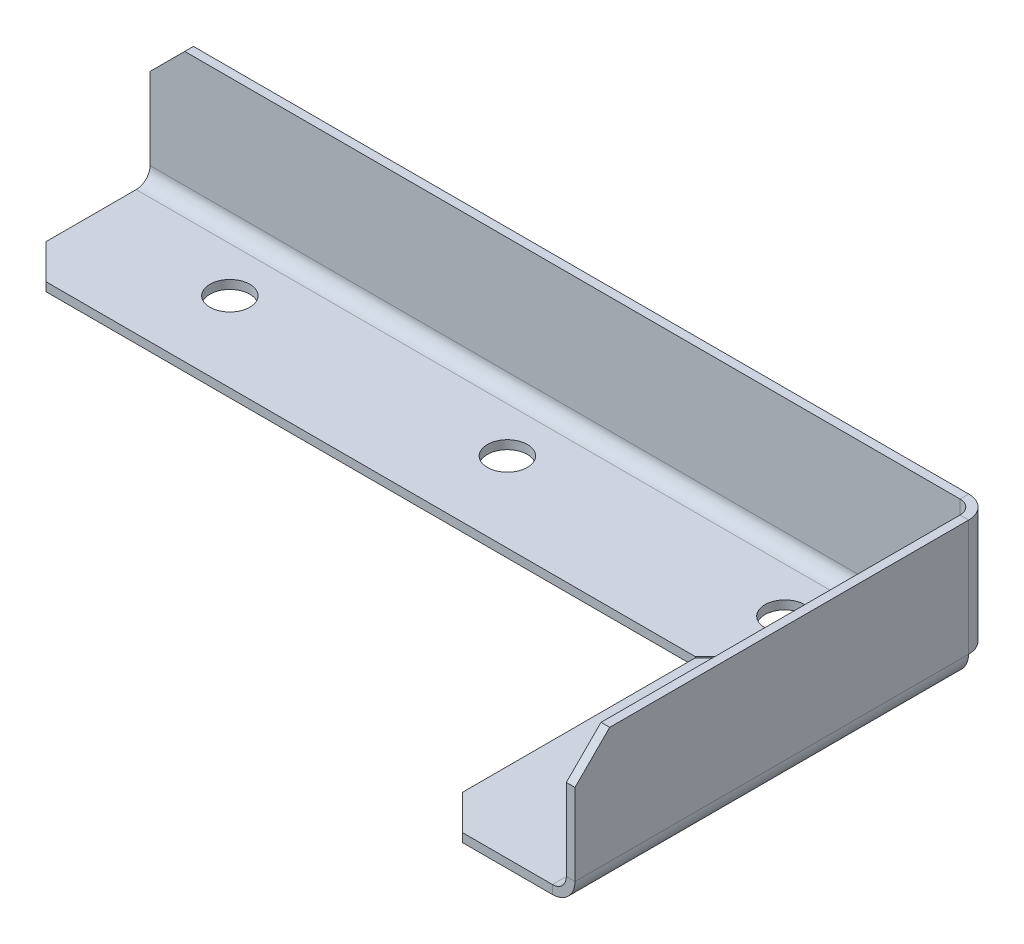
ISO-10303-21;
HEADER;
FILE_DESCRIPTION(('STEP AP214'),'2;1');
FILE_NAME('part.step','',(''),(''),'','','');
FILE_SCHEMA(('AUTOMOTIVE_DESIGN { 1 0 10303 214 1 1 1 1 }'));
ENDSEC;
DATA;
#1=APPLICATION_CONTEXT('core data for automotive mechanical design processes');
#2=APPLICATION_PROTOCOL_DEFINITION('international standard','automotive_design',2000,#1);
#3=PRODUCT_CONTEXT('',#1,'mechanical');
#4=PRODUCT('Part','Part','',(#3));
#5=PRODUCT_RELATED_PRODUCT_CATEGORY('part','',(#4));
#6=PRODUCT_DEFINITION_FORMATION('','',#4);
#7=PRODUCT_DEFINITION_CONTEXT('part definition',#1,'design');
#8=PRODUCT_DEFINITION('design','',#6,#7);
#9=PRODUCT_DEFINITION_SHAPE('','',#8);
#10=(LENGTH_UNIT() NAMED_UNIT(*) SI_UNIT(.MILLI.,.METRE.));
#11=(NAMED_UNIT(*) PLANE_ANGLE_UNIT() SI_UNIT($,.RADIAN.));
#12=(NAMED_UNIT(*) SI_UNIT($,.STERADIAN.) SOLID_ANGLE_UNIT());
#13=UNCERTAINTY_MEASURE_WITH_UNIT(LENGTH_MEASURE(1.E-05),#10,'distance_accuracy_value','');
#14=(GEOMETRIC_REPRESENTATION_CONTEXT(3) GLOBAL_UNCERTAINTY_ASSIGNED_CONTEXT((#13)) GLOBAL_UNIT_ASSIGNED_CONTEXT((#10,
#11,#12)) REPRESENTATION_CONTEXT('',''));
#15=CARTESIAN_POINT('',(0.,0.,0.));
#16=DIRECTION('',(0.,0.,1.));
#17=DIRECTION('',(1.,0.,0.));
#18=AXIS2_PLACEMENT_3D('',#15,#16,#17);
#19=CARTESIAN_POINT('',(-1.5875,4.1275,4.1275));
#20=DIRECTION('',(0.,-1.,0.));
#21=DIRECTION('',(0.,0.,-1.));
#22=AXIS2_PLACEMENT_3D('',#19,#20,#21);
#23=PLANE('',#22);
#24=CARTESIAN_POINT('',(-4.1275,4.1275,4.1275));
#25=DIRECTION('',(0.,1.,0.));
#26=DIRECTION('',(0.,0.,1.));
#27=AXIS2_PLACEMENT_3D('',#24,#25,#26);
#28=CIRCLE('',#27,4.1275);
#29=CARTESIAN_POINT('',(-4.1275000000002,4.1275,0.));
#30=VERTEX_POINT('',#29);
#31=CARTESIAN_POINT('',(0.,4.1275,4.1275));
#32=VERTEX_POINT('',#31);
#33=EDGE_CURVE('E263',#30,#32,#28,.F.);
#34=ORIENTED_EDGE('',*,*,#33,.T.);
#35=DIRECTION('',(1.,0.,0.));
#36=VECTOR('',#35,1.);
#37=CARTESIAN_POINT('',(0.,4.1275,4.12749999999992));
#38=LINE('',#37,#36);
#39=CARTESIAN_POINT('',(-1.5875,4.1275,4.1275));
#40=VERTEX_POINT('',#39);
#41=EDGE_CURVE('E175',#32,#40,#38,.F.);
#42=ORIENTED_EDGE('',*,*,#41,.T.);
#43=CARTESIAN_POINT('',(-4.1275,4.1275,4.1275));
#44=DIRECTION('',(0.,1.,0.));
#45=DIRECTION('',(0.,0.,1.));
#46=AXIS2_PLACEMENT_3D('',#43,#44,#45);
#47=CIRCLE('',#46,2.54);
#48=CARTESIAN_POINT('',(-4.1275,4.1275,1.5875));
#49=VERTEX_POINT('',#48);
#50=EDGE_CURVE('E267',#49,#40,#47,.F.);
#51=ORIENTED_EDGE('',*,*,#50,.F.);
#52=DIRECTION('',(0.,0.,-1.));
#53=VECTOR('',#52,1.);
#54=CARTESIAN_POINT('',(-4.1275000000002,4.1275,0.));
#55=LINE('',#54,#53);
#56=EDGE_CURVE('E230',#30,#49,#55,.F.);
#57=ORIENTED_EDGE('',*,*,#56,.F.);
#58=EDGE_LOOP('',(#34,#42,#51,#57));
#59=FACE_BOUND('',#58,.T.);
#60=ADVANCED_FACE('F30',(#59),#23,.T.);
#61=CARTESIAN_POINT('',(-1.5875,25.4,0.));
#62=DIRECTION('',(1.,0.,0.));
#63=DIRECTION('',(0.,0.,-1.));
#64=AXIS2_PLACEMENT_3D('',#61,#62,#63);
#65=PLANE('',#64);
#66=DIRECTION('',(0.,-1.,0.));
#67=VECTOR('',#66,1.);
#68=CARTESIAN_POINT('',(-1.58749999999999,25.4,76.2));
#69=LINE('',#68,#67);
#70=CARTESIAN_POINT('',(-1.58749999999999,19.05,76.2));
#71=VERTEX_POINT('',#70);
#72=CARTESIAN_POINT('',(-1.58749999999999,4.1275,76.2));
#73=VERTEX_POINT('',#72);
#74=EDGE_CURVE('E301',#71,#73,#69,.T.);
#75=ORIENTED_EDGE('',*,*,#74,.F.);
#76=DIRECTION('',(0.,-0.707106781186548,0.707106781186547));
#77=VECTOR('',#76,1.);
#78=CARTESIAN_POINT('',(-1.58749999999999,19.05,76.2));
#79=LINE('',#78,#77);
#80=CARTESIAN_POINT('',(-1.58749999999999,25.4,69.85));
#81=VERTEX_POINT('',#80);
#82=EDGE_CURVE('E52',#71,#81,#79,.F.);
#83=ORIENTED_EDGE('',*,*,#82,.T.);
#84=DIRECTION('',(0.,0.,1.));
#85=VECTOR('',#84,1.);
#86=CARTESIAN_POINT('',(-1.5875,25.4,0.));
#87=LINE('',#86,#85);
#88=CARTESIAN_POINT('',(-1.5875,25.4,4.1275));
#89=VERTEX_POINT('',#88);
#90=EDGE_CURVE('E270',#89,#81,#87,.T.);
#91=ORIENTED_EDGE('',*,*,#90,.F.);
#92=DIRECTION('',(0.,-1.,0.));
#93=VECTOR('',#92,1.);
#94=CARTESIAN_POINT('',(-1.5875,25.4,4.1275));
#95=LINE('',#94,#93);
#96=EDGE_CURVE('E284',#89,#40,#95,.T.);
#97=ORIENTED_EDGE('',*,*,#96,.T.);
#98=DIRECTION('',(0.,0.,1.));
#99=VECTOR('',#98,1.);
#100=CARTESIAN_POINT('',(-1.58749999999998,4.1275,4.12749999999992));
#101=LINE('',#100,#99);
#102=EDGE_CURVE('E348',#40,#73,#101,.T.);
#103=ORIENTED_EDGE('',*,*,#102,.T.);
#104=EDGE_LOOP('',(#75,#83,#91,#97,#103));
#105=FACE_BOUND('',#104,.T.);
#106=ADVANCED_FACE('F346',(#105),#65,.F.);
#107=CARTESIAN_POINT('',(0.,25.4,76.2));
#108=DIRECTION('',(0.,0.,1.));
#109=DIRECTION('',(1.,0.,0.));
#110=AXIS2_PLACEMENT_3D('',#107,#108,#109);
#111=PLANE('',#110);
#112=DIRECTION('',(0.,-1.,0.));
#113=VECTOR('',#112,1.);
#114=CARTESIAN_POINT('',(0.,25.4,76.2));
#115=LINE('',#114,#113);
#116=CARTESIAN_POINT('',(0.,19.05,76.2));
#117=VERTEX_POINT('',#116);
#118=CARTESIAN_POINT('',(1.27208147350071E-13,4.1275,76.1999999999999));
#119=VERTEX_POINT('',#118);
#120=EDGE_CURVE('E299',#117,#119,#115,.T.);
#121=ORIENTED_EDGE('',*,*,#120,.F.);
#122=DIRECTION('',(-1.,0.,0.));
#123=VECTOR('',#122,1.);
#124=CARTESIAN_POINT('',(0.,19.05,76.2));
#125=LINE('',#124,#123);
#126=EDGE_CURVE('E335',#117,#71,#125,.T.);
#127=ORIENTED_EDGE('',*,*,#126,.T.);
#128=ORIENTED_EDGE('',*,*,#74,.T.);
#129=DIRECTION('',(1.,0.,0.));
#130=VECTOR('',#129,1.);
#131=CARTESIAN_POINT('',(1.27208147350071E-13,4.1275,76.1999999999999));
#132=LINE('',#131,#130);
#133=EDGE_CURVE('E361',#119,#73,#132,.F.);
#134=ORIENTED_EDGE('',*,*,#133,.F.);
#135=EDGE_LOOP('',(#121,#127,#128,#134));
#136=FACE_BOUND('',#135,.T.);
#137=ADVANCED_FACE('F341',(#136),#111,.T.);
#138=CARTESIAN_POINT('',(0.,25.4,0.));
#139=DIRECTION('',(1.,0.,0.));
#140=DIRECTION('',(0.,0.,-1.));
#141=AXIS2_PLACEMENT_3D('',#138,#139,#140);
#142=PLANE('',#141);
#143=DIRECTION('',(0.,0.,1.));
#144=VECTOR('',#143,1.);
#145=CARTESIAN_POINT('',(0.,25.4,0.));
#146=LINE('',#145,#144);
#147=CARTESIAN_POINT('',(0.,25.4,4.1275));
#148=VERTEX_POINT('',#147);
#149=CARTESIAN_POINT('',(0.,25.4,69.85));
#150=VERTEX_POINT('',#149);
#151=EDGE_CURVE('E272',#148,#150,#146,.T.);
#152=ORIENTED_EDGE('',*,*,#151,.T.);
#153=DIRECTION('',(0.,0.707106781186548,-0.707106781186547));
#154=VECTOR('',#153,1.);
#155=CARTESIAN_POINT('',(0.,60.325,34.925));
#156=LINE('',#155,#154);
#157=EDGE_CURVE('E11',#150,#117,#156,.F.);
#158=ORIENTED_EDGE('',*,*,#157,.T.);
#159=ORIENTED_EDGE('',*,*,#120,.T.);
#160=DIRECTION('',(0.,0.,1.));
#161=VECTOR('',#160,1.);
#162=CARTESIAN_POINT('',(0.,4.1275,4.12749999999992));
#163=LINE('',#162,#161);
#164=EDGE_CURVE('E179',#32,#119,#163,.T.);
#165=ORIENTED_EDGE('',*,*,#164,.F.);
#166=DIRECTION('',(0.,-1.,0.));
#167=VECTOR('',#166,1.);
#168=CARTESIAN_POINT('',(0.,25.4,4.1275));
#169=LINE('',#168,#167);
#170=EDGE_CURVE('E296',#148,#32,#169,.T.);
#171=ORIENTED_EDGE('',*,*,#170,.F.);
#172=EDGE_LOOP('',(#152,#158,#159,#165,#171));
#173=FACE_BOUND('',#172,.T.);
#174=ADVANCED_FACE('F437',(#173),#142,.T.);
#175=CARTESIAN_POINT('',(-4.1275,25.4,4.1275));
#176=DIRECTION('',(0.,-1.,0.));
#177=DIRECTION('',(0.,0.,-1.));
#178=AXIS2_PLACEMENT_3D('',#175,#176,#177);
#179=CYLINDRICAL_SURFACE('',#178,4.1275);
#180=ORIENTED_EDGE('',*,*,#170,.T.);
#181=ORIENTED_EDGE('',*,*,#33,.F.);
#182=DIRECTION('',(0.,-1.,0.));
#183=VECTOR('',#182,1.);
#184=CARTESIAN_POINT('',(-4.1275,25.4,0.));
#185=LINE('',#184,#183);
#186=CARTESIAN_POINT('',(-4.1275,25.4,0.));
#187=VERTEX_POINT('',#186);
#188=EDGE_CURVE('E294',#187,#30,#185,.T.);
#189=ORIENTED_EDGE('',*,*,#188,.F.);
#190=CARTESIAN_POINT('',(-4.1275,25.4,4.1275));
#191=DIRECTION('',(0.,1.,0.));
#192=DIRECTION('',(0.,0.,1.));
#193=AXIS2_PLACEMENT_3D('',#190,#191,#192);
#194=CIRCLE('',#193,4.1275);
#195=EDGE_CURVE('E274',#187,#148,#194,.F.);
#196=ORIENTED_EDGE('',*,*,#195,.T.);
#197=EDGE_LOOP('',(#180,#181,#189,#196));
#198=FACE_BOUND('',#197,.T.);
#199=ADVANCED_FACE('F434',(#198),#179,.T.);
#200=CARTESIAN_POINT('',(0.,25.4,0.));
#201=DIRECTION('',(0.,0.,-1.));
#202=DIRECTION('',(-1.,0.,0.));
#203=AXIS2_PLACEMENT_3D('',#200,#201,#202);
#204=PLANE('',#203);
#205=DIRECTION('',(0.,-1.,0.));
#206=VECTOR('',#205,1.);
#207=CARTESIAN_POINT('',(-152.4,25.4,0.));
#208=LINE('',#207,#206);
#209=CARTESIAN_POINT('',(-152.4,19.05,0.));
#210=VERTEX_POINT('',#209);
#211=CARTESIAN_POINT('',(-152.4,4.1275,0.));
#212=VERTEX_POINT('',#211);
#213=EDGE_CURVE('E292',#210,#212,#208,.T.);
#214=ORIENTED_EDGE('',*,*,#213,.F.);
#215=DIRECTION('',(-0.707106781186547,-0.707106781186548,0.));
#216=VECTOR('',#215,1.);
#217=CARTESIAN_POINT('',(-73.0250000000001,98.425,0.));
#218=LINE('',#217,#216);
#219=CARTESIAN_POINT('',(-146.05,25.4,0.));
#220=VERTEX_POINT('',#219);
#221=EDGE_CURVE('E329',#210,#220,#218,.F.);
#222=ORIENTED_EDGE('',*,*,#221,.T.);
#223=DIRECTION('',(1.,0.,0.));
#224=VECTOR('',#223,1.);
#225=CARTESIAN_POINT('',(0.,25.4,0.));
#226=LINE('',#225,#224);
#227=EDGE_CURVE('E277',#220,#187,#226,.T.);
#228=ORIENTED_EDGE('',*,*,#227,.T.);
#229=ORIENTED_EDGE('',*,*,#188,.T.);
#230=DIRECTION('',(1.,0.,0.));
#231=VECTOR('',#230,1.);
#232=CARTESIAN_POINT('',(-893.7625,4.1275,0.));
#233=LINE('',#232,#231);
#234=EDGE_CURVE('E205',#212,#30,#233,.T.);
#235=ORIENTED_EDGE('',*,*,#234,.F.);
#236=EDGE_LOOP('',(#214,#222,#228,#229,#235));
#237=FACE_BOUND('',#236,.T.);
#238=ADVANCED_FACE('F430',(#237),#204,.T.);
#239=CARTESIAN_POINT('',(-152.4,25.4,1.58750000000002));
#240=DIRECTION('',(-1.,0.,0.));
#241=DIRECTION('',(0.,0.,1.));
#242=AXIS2_PLACEMENT_3D('',#239,#240,#241);
#243=PLANE('',#242);
#244=DIRECTION('',(0.,-1.,0.));
#245=VECTOR('',#244,1.);
#246=CARTESIAN_POINT('',(-152.4,25.4,1.58750000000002));
#247=LINE('',#246,#245);
#248=CARTESIAN_POINT('',(-152.4,19.05,1.58750000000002));
#249=VERTEX_POINT('',#248);
#250=CARTESIAN_POINT('',(-152.4,4.1275,1.58750000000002));
#251=VERTEX_POINT('',#250);
#252=EDGE_CURVE('E290',#249,#251,#247,.T.);
#253=ORIENTED_EDGE('',*,*,#252,.F.);
#254=DIRECTION('',(0.,0.,-1.));
#255=VECTOR('',#254,1.);
#256=CARTESIAN_POINT('',(-152.4,19.05,1.58750000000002));
#257=LINE('',#256,#255);
#258=EDGE_CURVE('E326',#249,#210,#257,.T.);
#259=ORIENTED_EDGE('',*,*,#258,.T.);
#260=ORIENTED_EDGE('',*,*,#213,.T.);
#261=DIRECTION('',(0.,0.,-1.));
#262=VECTOR('',#261,1.);
#263=CARTESIAN_POINT('',(-152.4,4.1275,0.));
#264=LINE('',#263,#262);
#265=EDGE_CURVE('E231',#212,#251,#264,.F.);
#266=ORIENTED_EDGE('',*,*,#265,.T.);
#267=EDGE_LOOP('',(#253,#259,#260,#266));
#268=FACE_BOUND('',#267,.T.);
#269=ADVANCED_FACE('F426',(#268),#243,.T.);
#270=CARTESIAN_POINT('',(0.,25.4,1.5875));
#271=DIRECTION('',(0.,0.,-1.));
#272=DIRECTION('',(-1.,0.,0.));
#273=AXIS2_PLACEMENT_3D('',#270,#271,#272);
#274=PLANE('',#273);
#275=DIRECTION('',(1.,0.,0.));
#276=VECTOR('',#275,1.);
#277=CARTESIAN_POINT('',(0.,25.4,1.5875));
#278=LINE('',#277,#276);
#279=CARTESIAN_POINT('',(-146.05,25.4,1.58750000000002));
#280=VERTEX_POINT('',#279);
#281=CARTESIAN_POINT('',(-4.1275,25.4,1.5875));
#282=VERTEX_POINT('',#281);
#283=EDGE_CURVE('E279',#280,#282,#278,.T.);
#284=ORIENTED_EDGE('',*,*,#283,.F.);
#285=DIRECTION('',(0.707106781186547,0.707106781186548,0.));
#286=VECTOR('',#285,1.);
#287=CARTESIAN_POINT('',(-152.4,19.05,1.58750000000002));
#288=LINE('',#287,#286);
#289=EDGE_CURVE('E333',#280,#249,#288,.F.);
#290=ORIENTED_EDGE('',*,*,#289,.T.);
#291=ORIENTED_EDGE('',*,*,#252,.T.);
#292=DIRECTION('',(1.,0.,0.));
#293=VECTOR('',#292,1.);
#294=CARTESIAN_POINT('',(-893.7625,4.1275,1.58750000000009));
#295=LINE('',#294,#293);
#296=EDGE_CURVE('E222',#251,#49,#295,.T.);
#297=ORIENTED_EDGE('',*,*,#296,.T.);
#298=DIRECTION('',(0.,-1.,0.));
#299=VECTOR('',#298,1.);
#300=CARTESIAN_POINT('',(-4.1275,25.4,1.5875));
#301=LINE('',#300,#299);
#302=EDGE_CURVE('E287',#282,#49,#301,.T.);
#303=ORIENTED_EDGE('',*,*,#302,.F.);
#304=EDGE_LOOP('',(#284,#290,#291,#297,#303));
#305=FACE_BOUND('',#304,.T.);
#306=ADVANCED_FACE('F422',(#305),#274,.F.);
#307=CARTESIAN_POINT('',(-4.1275,25.4,4.1275));
#308=DIRECTION('',(0.,-1.,0.));
#309=DIRECTION('',(0.,0.,-1.));
#310=AXIS2_PLACEMENT_3D('',#307,#308,#309);
#311=CYLINDRICAL_SURFACE('',#310,2.54);
#312=ORIENTED_EDGE('',*,*,#50,.T.);
#313=ORIENTED_EDGE('',*,*,#96,.F.);
#314=CARTESIAN_POINT('',(-4.1275,25.4,4.1275));
#315=DIRECTION('',(0.,1.,0.));
#316=DIRECTION('',(1.,0.,0.));
#317=AXIS2_PLACEMENT_3D('',#314,#315,#316);
#318=CIRCLE('',#317,2.54);
#319=EDGE_CURVE('E281',#282,#89,#318,.F.);
#320=ORIENTED_EDGE('',*,*,#319,.F.);
#321=ORIENTED_EDGE('',*,*,#302,.T.);
#322=EDGE_LOOP('',(#312,#313,#320,#321));
#323=FACE_BOUND('',#322,.T.);
#324=ADVANCED_FACE('F419',(#323),#311,.F.);
#325=CARTESIAN_POINT('',(0.,25.4,4.1275));
#326=DIRECTION('',(0.,1.,0.));
#327=DIRECTION('',(0.,0.,1.));
#328=AXIS2_PLACEMENT_3D('',#325,#326,#327);
#329=PLANE('',#328);
#330=DIRECTION('',(-1.,0.,0.));
#331=VECTOR('',#330,1.);
#332=CARTESIAN_POINT('',(0.,25.4,4.1275));
#333=LINE('',#332,#331);
#334=EDGE_CURVE('E306',#148,#89,#333,.T.);
#335=ORIENTED_EDGE('',*,*,#334,.F.);
#336=ORIENTED_EDGE('',*,*,#195,.F.);
#337=DIRECTION('',(0.,0.,-1.));
#338=VECTOR('',#337,1.);
#339=CARTESIAN_POINT('',(-4.1275,25.4,1.5875));
#340=LINE('',#339,#338);
#341=EDGE_CURVE('E303',#282,#187,#340,.T.);
#342=ORIENTED_EDGE('',*,*,#341,.F.);
#343=ORIENTED_EDGE('',*,*,#319,.T.);
#344=EDGE_LOOP('',(#335,#336,#342,#343));
#345=FACE_BOUND('',#344,.T.);
#346=ADVANCED_FACE('F32',(#345),#329,.T.);
#347=CARTESIAN_POINT('',(-4.1275,25.4,1.5875));
#348=DIRECTION('',(0.,1.,0.));
#349=DIRECTION('',(0.,0.,1.));
#350=AXIS2_PLACEMENT_3D('',#347,#348,#349);
#351=PLANE('',#350);
#352=ORIENTED_EDGE('',*,*,#90,.T.);
#353=DIRECTION('',(1.,0.,0.));
#354=VECTOR('',#353,1.);
#355=CARTESIAN_POINT('',(-4.1275,25.4,69.85));
#356=LINE('',#355,#354);
#357=EDGE_CURVE('E38',#81,#150,#356,.T.);
#358=ORIENTED_EDGE('',*,*,#357,.T.);
#359=ORIENTED_EDGE('',*,*,#151,.F.);
#360=ORIENTED_EDGE('',*,*,#334,.T.);
#361=EDGE_LOOP('',(#352,#358,#359,#360));
#362=FACE_BOUND('',#361,.T.);
#363=ADVANCED_FACE('F417',(#362),#351,.T.);
#364=CARTESIAN_POINT('',(-4.1275,25.4,4.1275));
#365=DIRECTION('',(0.,1.,0.));
#366=DIRECTION('',(0.,0.,1.));
#367=AXIS2_PLACEMENT_3D('',#364,#365,#366);
#368=PLANE('',#367);
#369=ORIENTED_EDGE('',*,*,#227,.F.);
#370=DIRECTION('',(0.,0.,1.));
#371=VECTOR('',#370,1.);
#372=CARTESIAN_POINT('',(-146.05,25.4,4.1275));
#373=LINE('',#372,#371);
#374=EDGE_CURVE('E331',#220,#280,#373,.T.);
#375=ORIENTED_EDGE('',*,*,#374,.T.);
#376=ORIENTED_EDGE('',*,*,#283,.T.);
#377=ORIENTED_EDGE('',*,*,#341,.T.);
#378=EDGE_LOOP('',(#369,#375,#376,#377));
#379=FACE_BOUND('',#378,.T.);
#380=ADVANCED_FACE('F413',(#379),#368,.T.);
#381=CARTESIAN_POINT('',(-152.4,0.,26.9875));
#382=DIRECTION('',(0.,0.,-1.));
#383=DIRECTION('',(1.,0.,0.));
#384=AXIS2_PLACEMENT_3D('',#381,#382,#383);
#385=PLANE('',#384);
#386=DIRECTION('',(1.,0.,0.));
#387=VECTOR('',#386,1.);
#388=CARTESIAN_POINT('',(-152.4,1.5875,26.9875));
#389=LINE('',#388,#387);
#390=CARTESIAN_POINT('',(-146.05,1.5875,26.9875));
#391=VERTEX_POINT('',#390);
#392=CARTESIAN_POINT('',(-27.16710512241,1.5875,26.9875));
#393=VERTEX_POINT('',#392);
#394=EDGE_CURVE('E246',#391,#393,#389,.T.);
#395=ORIENTED_EDGE('',*,*,#394,.F.);
#396=DIRECTION('',(0.,-1.,0.));
#397=VECTOR('',#396,1.);
#398=CARTESIAN_POINT('',(-146.05,0.,26.9875));
#399=LINE('',#398,#397);
#400=CARTESIAN_POINT('',(-146.05,0.,26.9875));
#401=VERTEX_POINT('',#400);
#402=EDGE_CURVE('E313',#391,#401,#399,.T.);
#403=ORIENTED_EDGE('',*,*,#402,.T.);
#404=DIRECTION('',(1.,0.,0.));
#405=VECTOR('',#404,1.);
#406=CARTESIAN_POINT('',(-152.4,0.,26.9875));
#407=LINE('',#406,#405);
#408=CARTESIAN_POINT('',(-27.16710512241,0.,26.9875));
#409=VERTEX_POINT('',#408);
#410=EDGE_CURVE('E234',#401,#409,#407,.T.);
#411=ORIENTED_EDGE('',*,*,#410,.T.);
#412=DIRECTION('',(0.,-1.,0.));
#413=VECTOR('',#412,1.);
#414=CARTESIAN_POINT('',(-27.16710512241,0.,26.9875));
#415=LINE('',#414,#413);
#416=EDGE_CURVE('E260',#409,#393,#415,.F.);
#417=ORIENTED_EDGE('',*,*,#416,.T.);
#418=EDGE_LOOP('',(#395,#403,#411,#417));
#419=FACE_BOUND('',#418,.T.);
#420=ADVANCED_FACE('F416',(#419),#385,.F.);
#421=CARTESIAN_POINT('',(-152.4,0.,26.9875));
#422=DIRECTION('',(-1.,0.,0.));
#423=DIRECTION('',(0.,0.,-1.));
#424=AXIS2_PLACEMENT_3D('',#421,#422,#423);
#425=PLANE('',#424);
#426=DIRECTION('',(0.,0.,-1.));
#427=VECTOR('',#426,1.);
#428=CARTESIAN_POINT('',(-152.4,0.,26.9875));
#429=LINE('',#428,#427);
#430=CARTESIAN_POINT('',(-152.4,0.,20.6375));
#431=VERTEX_POINT('',#430);
#432=CARTESIAN_POINT('',(-152.4,0.,4.1275));
#433=VERTEX_POINT('',#432);
#434=EDGE_CURVE('E241',#431,#433,#429,.T.);
#435=ORIENTED_EDGE('',*,*,#434,.F.);
#436=DIRECTION('',(0.,-1.,0.));
#437=VECTOR('',#436,1.);
#438=CARTESIAN_POINT('',(-152.4,0.,20.6375));
#439=LINE('',#438,#437);
#440=CARTESIAN_POINT('',(-152.4,1.5875,20.6375));
#441=VERTEX_POINT('',#440);
#442=EDGE_CURVE('E308',#431,#441,#439,.F.);
#443=ORIENTED_EDGE('',*,*,#442,.T.);
#444=DIRECTION('',(0.,0.,-1.));
#445=VECTOR('',#444,1.);
#446=CARTESIAN_POINT('',(-152.4,1.5875,26.9875));
#447=LINE('',#446,#445);
#448=CARTESIAN_POINT('',(-152.4,1.5875,4.1275));
#449=VERTEX_POINT('',#448);
#450=EDGE_CURVE('E251',#441,#449,#447,.T.);
#451=ORIENTED_EDGE('',*,*,#450,.T.);
#452=DIRECTION('',(0.,-1.,0.));
#453=VECTOR('',#452,1.);
#454=CARTESIAN_POINT('',(-152.4,0.,4.1275));
#455=LINE('',#454,#453);
#456=EDGE_CURVE('E257',#433,#449,#455,.F.);
#457=ORIENTED_EDGE('',*,*,#456,.F.);
#458=EDGE_LOOP('',(#435,#443,#451,#457));
#459=FACE_BOUND('',#458,.T.);
#460=ADVANCED_FACE('F646',(#459),#425,.T.);
#461=CARTESIAN_POINT('',(-89.7835525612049,0.,89.6039474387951));
#462=DIRECTION('',(0.707106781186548,0.,0.707106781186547));
#463=DIRECTION('',(-0.707106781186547,0.,0.707106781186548));
#464=AXIS2_PLACEMENT_3D('',#461,#462,#463);
#465=PLANE('',#464);
#466=DIRECTION('',(-0.707106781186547,0.,0.707106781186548));
#467=VECTOR('',#466,1.);
#468=CARTESIAN_POINT('',(-89.7835525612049,0.,89.6039474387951));
#469=LINE('',#468,#467);
#470=CARTESIAN_POINT('',(-4.30710512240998,0.,4.12749999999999));
#471=VERTEX_POINT('',#470);
#472=EDGE_CURVE('E240',#471,#409,#469,.T.);
#473=ORIENTED_EDGE('',*,*,#472,.F.);
#474=DIRECTION('',(0.,-1.,0.));
#475=VECTOR('',#474,1.);
#476=CARTESIAN_POINT('',(-4.30710512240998,0.,4.12749999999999));
#477=LINE('',#476,#475);
#478=CARTESIAN_POINT('',(-4.30710512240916,1.5875,4.12749999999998));
#479=VERTEX_POINT('',#478);
#480=EDGE_CURVE('E256',#471,#479,#477,.F.);
#481=ORIENTED_EDGE('',*,*,#480,.T.);
#482=DIRECTION('',(-0.707106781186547,0.,0.707106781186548));
#483=VECTOR('',#482,1.);
#484=CARTESIAN_POINT('',(-89.7835525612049,1.58749999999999,89.6039474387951));
#485=LINE('',#484,#483);
#486=EDGE_CURVE('E250',#479,#393,#485,.T.);
#487=ORIENTED_EDGE('',*,*,#486,.T.);
#488=ORIENTED_EDGE('',*,*,#416,.F.);
#489=EDGE_LOOP('',(#473,#481,#487,#488));
#490=FACE_BOUND('',#489,.T.);
#491=ADVANCED_FACE('F411',(#490),#465,.T.);
#492=CARTESIAN_POINT('',(-152.4,1.5875,26.9875));
#493=DIRECTION('',(0.,-1.,0.));
#494=DIRECTION('',(0.,0.,-1.));
#495=AXIS2_PLACEMENT_3D('',#492,#493,#494);
#496=PLANE('',#495);
#497=CARTESIAN_POINT('',(-76.2000000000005,1.58750000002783,12.3825));
#498=DIRECTION('',(0.,1.,0.));
#499=DIRECTION('',(0.,0.,1.));
#500=AXIS2_PLACEMENT_3D('',#497,#498,#499);
#501=CIRCLE('',#500,3.65125000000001);
#502=CARTESIAN_POINT('',(-76.2000000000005,1.58750000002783,16.03375));
#503=VERTEX_POINT('',#502);
#504=EDGE_CURVE('E515',#503,#503,#501,.T.);
#505=ORIENTED_EDGE('',*,*,#504,.F.);
#506=EDGE_LOOP('',(#505));
#507=FACE_BOUND('',#506,.T.);
#508=CARTESIAN_POINT('',(-25.4000000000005,1.58750000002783,12.3825));
#509=DIRECTION('',(0.,1.,0.));
#510=DIRECTION('',(0.,0.,1.));
#511=AXIS2_PLACEMENT_3D('',#508,#509,#510);
#512=CIRCLE('',#511,3.65125000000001);
#513=CARTESIAN_POINT('',(-25.4000000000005,1.58750000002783,16.03375));
#514=VERTEX_POINT('',#513);
#515=EDGE_CURVE('E498',#514,#514,#512,.T.);
#516=ORIENTED_EDGE('',*,*,#515,.F.);
#517=EDGE_LOOP('',(#516));
#518=FACE_BOUND('',#517,.T.);
#519=CARTESIAN_POINT('',(-127.000000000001,1.58750000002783,12.3825));
#520=DIRECTION('',(0.,1.,0.));
#521=DIRECTION('',(0.,0.,1.));
#522=AXIS2_PLACEMENT_3D('',#519,#520,#521);
#523=CIRCLE('',#522,3.65124999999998);
#524=CARTESIAN_POINT('',(-127.000000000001,1.58750000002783,16.03375));
#525=VERTEX_POINT('',#524);
#526=EDGE_CURVE('E489',#525,#525,#523,.T.);
#527=ORIENTED_EDGE('',*,*,#526,.F.);
#528=EDGE_LOOP('',(#527));
#529=FACE_BOUND('',#528,.T.);
#530=ORIENTED_EDGE('',*,*,#450,.F.);
#531=DIRECTION('',(0.707106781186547,0.,0.707106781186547));
#532=VECTOR('',#531,1.);
#533=CARTESIAN_POINT('',(-152.4,1.5875,20.6375));
#534=LINE('',#533,#532);
#535=EDGE_CURVE('E311',#441,#391,#534,.T.);
#536=ORIENTED_EDGE('',*,*,#535,.T.);
#537=ORIENTED_EDGE('',*,*,#394,.T.);
#538=ORIENTED_EDGE('',*,*,#486,.F.);
#539=DIRECTION('',(1.,0.,0.));
#540=VECTOR('',#539,1.);
#541=CARTESIAN_POINT('',(-152.4,1.5875,4.1275));
#542=LINE('',#541,#540);
#543=EDGE_CURVE('E247',#449,#479,#542,.T.);
#544=ORIENTED_EDGE('',*,*,#543,.F.);
#545=EDGE_LOOP('',(#530,#536,#537,#538,#544));
#546=FACE_BOUND('',#545,.T.);
#547=ADVANCED_FACE('F477',(#507,#518,#529,#546),#496,.F.);
#548=CARTESIAN_POINT('',(-152.4,0.,26.9875));
#549=DIRECTION('',(0.,-1.,0.));
#550=DIRECTION('',(0.,0.,-1.));
#551=AXIS2_PLACEMENT_3D('',#548,#549,#550);
#552=PLANE('',#551);
#553=CARTESIAN_POINT('',(-76.2000000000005,0.,12.3825));
#554=DIRECTION('',(0.,-1.,0.));
#555=DIRECTION('',(0.,0.,-1.));
#556=AXIS2_PLACEMENT_3D('',#553,#554,#555);
#557=CIRCLE('',#556,3.65125000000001);
#558=CARTESIAN_POINT('',(-76.2000000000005,0.,8.73125000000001));
#559=VERTEX_POINT('',#558);
#560=EDGE_CURVE('E518',#559,#559,#557,.F.);
#561=ORIENTED_EDGE('',*,*,#560,.T.);
#562=EDGE_LOOP('',(#561));
#563=FACE_BOUND('',#562,.T.);
#564=CARTESIAN_POINT('',(-25.4000000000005,0.,12.3825));
#565=DIRECTION('',(0.,-1.,0.));
#566=DIRECTION('',(0.,0.,-1.));
#567=AXIS2_PLACEMENT_3D('',#564,#565,#566);
#568=CIRCLE('',#567,3.65125000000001);
#569=CARTESIAN_POINT('',(-25.4000000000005,0.,8.73125000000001));
#570=VERTEX_POINT('',#569);
#571=EDGE_CURVE('E500',#570,#570,#568,.F.);
#572=ORIENTED_EDGE('',*,*,#571,.T.);
#573=EDGE_LOOP('',(#572));
#574=FACE_BOUND('',#573,.T.);
#575=CARTESIAN_POINT('',(-127.000000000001,0.,12.3825));
#576=DIRECTION('',(0.,-1.,0.));
#577=DIRECTION('',(0.,0.,-1.));
#578=AXIS2_PLACEMENT_3D('',#575,#576,#577);
#579=CIRCLE('',#578,3.65124999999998);
#580=CARTESIAN_POINT('',(-127.000000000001,0.,8.73125000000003));
#581=VERTEX_POINT('',#580);
#582=EDGE_CURVE('E492',#581,#581,#579,.F.);
#583=ORIENTED_EDGE('',*,*,#582,.T.);
#584=EDGE_LOOP('',(#583));
#585=FACE_BOUND('',#584,.T.);
#586=ORIENTED_EDGE('',*,*,#410,.F.);
#587=DIRECTION('',(-0.707106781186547,0.,-0.707106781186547));
#588=VECTOR('',#587,1.);
#589=CARTESIAN_POINT('',(-149.225,0.,23.8125));
#590=LINE('',#589,#588);
#591=EDGE_CURVE('E315',#401,#431,#590,.T.);
#592=ORIENTED_EDGE('',*,*,#591,.T.);
#593=ORIENTED_EDGE('',*,*,#434,.T.);
#594=DIRECTION('',(1.,0.,0.));
#595=VECTOR('',#594,1.);
#596=CARTESIAN_POINT('',(-152.4,0.,4.1275));
#597=LINE('',#596,#595);
#598=EDGE_CURVE('E237',#433,#471,#597,.T.);
#599=ORIENTED_EDGE('',*,*,#598,.T.);
#600=ORIENTED_EDGE('',*,*,#472,.T.);
#601=EDGE_LOOP('',(#586,#592,#593,#599,#600));
#602=FACE_BOUND('',#601,.T.);
#603=ADVANCED_FACE('F528',(#563,#574,#585,#602),#552,.T.);
#604=CARTESIAN_POINT('',(-152.4,4.1275,4.1275));
#605=DIRECTION('',(1.,0.,0.));
#606=DIRECTION('',(0.,0.,-1.));
#607=AXIS2_PLACEMENT_3D('',#604,#605,#606);
#608=PLANE('',#607);
#609=ORIENTED_EDGE('',*,*,#456,.T.);
#610=CARTESIAN_POINT('',(-152.4,4.1275,4.1275));
#611=DIRECTION('',(1.,0.,0.));
#612=DIRECTION('',(0.,0.,-1.));
#613=AXIS2_PLACEMENT_3D('',#610,#611,#612);
#614=CIRCLE('',#613,2.54);
#615=EDGE_CURVE('E225',#449,#251,#614,.T.);
#616=ORIENTED_EDGE('',*,*,#615,.T.);
#617=ORIENTED_EDGE('',*,*,#265,.F.);
#618=CARTESIAN_POINT('',(-152.4,4.1275,4.1275));
#619=DIRECTION('',(-1.,0.,0.));
#620=DIRECTION('',(0.,0.,1.));
#621=AXIS2_PLACEMENT_3D('',#618,#619,#620);
#622=CIRCLE('',#621,4.1275);
#623=EDGE_CURVE('E209',#433,#212,#622,.F.);
#624=ORIENTED_EDGE('',*,*,#623,.F.);
#625=EDGE_LOOP('',(#609,#616,#617,#624));
#626=FACE_BOUND('',#625,.T.);
#627=ADVANCED_FACE('F467',(#626),#608,.F.);
#628=CARTESIAN_POINT('',(-3.94789487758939,8.255,4.12749999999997));
#629=CARTESIAN_POINT('',(-3.94789487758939,7.72583333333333,4.12749999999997));
#630=CARTESIAN_POINT('',(-3.94789487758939,7.19666666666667,4.12749999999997));
#631=CARTESIAN_POINT('',(-3.94789487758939,6.6675,4.12749999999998));
#632=CARTESIAN_POINT('',(-3.94789487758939,8.25499999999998,-4.12750000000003));
#633=CARTESIAN_POINT('',(-3.94789487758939,7.72583333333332,-3.06916666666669));
#634=CARTESIAN_POINT('',(-3.94789487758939,7.19666666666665,-2.01083333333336));
#635=CARTESIAN_POINT('',(-3.94789487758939,6.66749999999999,-0.952500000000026));
#636=CARTESIAN_POINT('',(-4.30710512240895,0.,-4.12750000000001));
#637=CARTESIAN_POINT('',(-4.30710512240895,0.529166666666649,-3.06916666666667));
#638=CARTESIAN_POINT('',(-4.30710512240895,1.05833333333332,-2.01083333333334));
#639=CARTESIAN_POINT('',(-4.30710512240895,1.58749999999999,-0.952500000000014));
#640=CARTESIAN_POINT('',(-4.30710512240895,0.,4.12749999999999));
#641=CARTESIAN_POINT('',(-4.30710512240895,0.529166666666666,4.12749999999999));
#642=CARTESIAN_POINT('',(-4.30710512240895,1.05833333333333,4.12749999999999));
#643=CARTESIAN_POINT('',(-4.30710512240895,1.5875,4.12749999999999));
#644=CARTESIAN_POINT('',(-4.30710512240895,0.,12.3825));
#645=CARTESIAN_POINT('',(-4.30710512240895,0.529166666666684,11.3241666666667));
#646=CARTESIAN_POINT('',(-4.30710512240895,1.05833333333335,10.2658333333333));
#647=CARTESIAN_POINT('',(-4.30710512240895,1.58750000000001,9.20749999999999));
#648=CARTESIAN_POINT('',(-3.94789487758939,8.25500000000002,12.3825));
#649=CARTESIAN_POINT('',(-3.94789487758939,7.72583333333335,11.3241666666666));
#650=CARTESIAN_POINT('',(-3.94789487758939,7.19666666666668,10.2658333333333));
#651=CARTESIAN_POINT('',(-3.94789487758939,6.66750000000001,9.20749999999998));
#652=CARTESIAN_POINT('',(-3.94789487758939,8.255,4.12749999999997));
#653=CARTESIAN_POINT('',(-3.94789487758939,7.72583333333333,4.12749999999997));
#654=CARTESIAN_POINT('',(-3.94789487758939,7.19666666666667,4.12749999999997));
#655=CARTESIAN_POINT('',(-3.94789487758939,6.6675,4.12749999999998));
#656=(BOUNDED_SURFACE() B_SPLINE_SURFACE(3,3,((#628,#629,#630,#631),(#632,#633,#634,#635),(#636,
#637,#638,#639),(#640,#641,#642,#643),(#644,#645,#646,#647),(#648,#649,#650,#651),(#652,#653,
#654,#655)),.UNSPECIFIED.,.T.,.F.,.F.) B_SPLINE_SURFACE_WITH_KNOTS((4,3,4),(4,4),(0.,0.5,1.),
(0.,1.),.UNSPECIFIED.) GEOMETRIC_REPRESENTATION_ITEM() RATIONAL_B_SPLINE_SURFACE(((1.,1.,1.,1.),
(0.333333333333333,0.333333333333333,0.333333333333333,0.333333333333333),(0.333333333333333,
0.333333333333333,0.333333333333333,0.333333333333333),(1.,1.,1.,1.),(0.333333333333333,
0.333333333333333,0.333333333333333,0.333333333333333),(0.333333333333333,0.333333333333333,
0.333333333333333,0.333333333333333),(1.,1.,1.,1.))) REPRESENTATION_ITEM('') SURFACE());
#657=CARTESIAN_POINT('',(-4.12749999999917,4.1275,4.12749999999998));
#658=DIRECTION('',(0.999054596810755,-0.0434731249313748,0.));
#659=DIRECTION('',(0.0434731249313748,0.999054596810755,0.));
#660=AXIS2_PLACEMENT_3D('',#657,#658,#659);
#661=ELLIPSE('',#660,4.13140584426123,4.1275);
#662=EDGE_CURVE('E219',#30,#471,#661,.F.);
#663=CARTESIAN_POINT('',(-4.12749999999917,4.1275,4.12749999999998));
#664=DIRECTION('',(0.997509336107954,-0.0705345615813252,0.));
#665=DIRECTION('',(0.0705345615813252,0.997509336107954,0.));
#666=AXIS2_PLACEMENT_3D('',#663,#664,#665);
#667=ELLIPSE('',#666,2.54634208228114,2.54);
#668=EDGE_CURVE('E228',#49,#479,#667,.F.);
#669=ORIENTED_EDGE('',*,*,#662,.F.);
#670=ORIENTED_EDGE('',*,*,#56,.T.);
#671=ORIENTED_EDGE('',*,*,#668,.T.);
#672=ORIENTED_EDGE('',*,*,#480,.F.);
#673=EDGE_LOOP('',(#669,#670,#671,#672));
#674=FACE_BOUND('',#673,.T.);
#675=ADVANCED_FACE('F483',(#674),#656,.F.);
#676=CARTESIAN_POINT('',(-893.7625,4.1275,4.12750000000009));
#677=DIRECTION('',(1.,0.,0.));
#678=DIRECTION('',(0.,0.,-1.));
#679=AXIS2_PLACEMENT_3D('',#676,#677,#678);
#680=CYLINDRICAL_SURFACE('',#679,2.54);
#681=ORIENTED_EDGE('',*,*,#296,.F.);
#682=ORIENTED_EDGE('',*,*,#615,.F.);
#683=ORIENTED_EDGE('',*,*,#543,.T.);
#684=ORIENTED_EDGE('',*,*,#668,.F.);
#685=EDGE_LOOP('',(#681,#682,#683,#684));
#686=FACE_BOUND('',#685,.T.);
#687=ADVANCED_FACE('F464',(#686),#680,.F.);
#688=CARTESIAN_POINT('',(-893.7625,4.1275,4.12750000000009));
#689=DIRECTION('',(1.,0.,0.));
#690=DIRECTION('',(0.,0.,-1.));
#691=AXIS2_PLACEMENT_3D('',#688,#689,#690);
#692=CYLINDRICAL_SURFACE('',#691,4.1275);
#693=ORIENTED_EDGE('',*,*,#234,.T.);
#694=ORIENTED_EDGE('',*,*,#662,.T.);
#695=ORIENTED_EDGE('',*,*,#598,.F.);
#696=ORIENTED_EDGE('',*,*,#623,.T.);
#697=EDGE_LOOP('',(#693,#694,#695,#696));
#698=FACE_BOUND('',#697,.T.);
#699=ADVANCED_FACE('F485',(#698),#692,.T.);
#700=CARTESIAN_POINT('',(-26.9874999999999,0.,76.2));
#701=DIRECTION('',(0.,0.,-1.));
#702=DIRECTION('',(1.,0.,0.));
#703=AXIS2_PLACEMENT_3D('',#700,#701,#702);
#704=PLANE('',#703);
#705=DIRECTION('',(1.,0.,0.));
#706=VECTOR('',#705,1.);
#707=CARTESIAN_POINT('',(-26.9874999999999,1.5875,76.1999999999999));
#708=LINE('',#707,#706);
#709=CARTESIAN_POINT('',(-4.12749999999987,1.5875,76.1999999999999));
#710=VERTEX_POINT('',#709);
#711=CARTESIAN_POINT('',(-20.6374999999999,1.5875,76.1999999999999));
#712=VERTEX_POINT('',#711);
#713=EDGE_CURVE('E371',#710,#712,#708,.F.);
#714=ORIENTED_EDGE('',*,*,#713,.T.);
#715=DIRECTION('',(0.,-1.,0.));
#716=VECTOR('',#715,1.);
#717=CARTESIAN_POINT('',(-20.6374999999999,0.,76.1999999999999));
#718=LINE('',#717,#716);
#719=CARTESIAN_POINT('',(-20.6374999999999,0.,76.1999999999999));
#720=VERTEX_POINT('',#719);
#721=EDGE_CURVE('E322',#712,#720,#718,.T.);
#722=ORIENTED_EDGE('',*,*,#721,.T.);
#723=DIRECTION('',(1.,0.,0.));
#724=VECTOR('',#723,1.);
#725=CARTESIAN_POINT('',(-26.9874999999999,0.,76.2));
#726=LINE('',#725,#724);
#727=CARTESIAN_POINT('',(-4.12749999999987,0.,76.1999999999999));
#728=VERTEX_POINT('',#727);
#729=EDGE_CURVE('E190',#728,#720,#726,.F.);
#730=ORIENTED_EDGE('',*,*,#729,.F.);
#731=DIRECTION('',(0.,-1.,0.));
#732=VECTOR('',#731,1.);
#733=CARTESIAN_POINT('',(-4.12749999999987,0.,76.1999999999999));
#734=LINE('',#733,#732);
#735=EDGE_CURVE('E206',#728,#710,#734,.F.);
#736=ORIENTED_EDGE('',*,*,#735,.T.);
#737=EDGE_LOOP('',(#714,#722,#730,#736));
#738=FACE_BOUND('',#737,.T.);
#739=ADVANCED_FACE('F376',(#738),#704,.F.);
#740=CARTESIAN_POINT('',(-26.9875,0.,4.12750000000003));
#741=DIRECTION('',(1.,0.,0.));
#742=DIRECTION('',(0.,0.,1.));
#743=AXIS2_PLACEMENT_3D('',#740,#741,#742);
#744=PLANE('',#743);
#745=DIRECTION('',(0.,0.,1.));
#746=VECTOR('',#745,1.);
#747=CARTESIAN_POINT('',(-26.9875,0.,4.12750000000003));
#748=LINE('',#747,#746);
#749=CARTESIAN_POINT('',(-26.9875,0.,27.167105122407));
#750=VERTEX_POINT('',#749);
#751=CARTESIAN_POINT('',(-26.9874999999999,0.,69.85));
#752=VERTEX_POINT('',#751);
#753=EDGE_CURVE('E191',#750,#752,#748,.T.);
#754=ORIENTED_EDGE('',*,*,#753,.T.);
#755=DIRECTION('',(0.,1.,0.));
#756=VECTOR('',#755,1.);
#757=CARTESIAN_POINT('',(-26.9874999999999,0.,69.85));
#758=LINE('',#757,#756);
#759=CARTESIAN_POINT('',(-26.9874999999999,1.5875,69.85));
#760=VERTEX_POINT('',#759);
#761=EDGE_CURVE('E317',#752,#760,#758,.T.);
#762=ORIENTED_EDGE('',*,*,#761,.T.);
#763=DIRECTION('',(0.,0.,1.));
#764=VECTOR('',#763,1.);
#765=CARTESIAN_POINT('',(-26.9875,1.5875,4.12750000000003));
#766=LINE('',#765,#764);
#767=CARTESIAN_POINT('',(-26.9875,1.5875,27.167105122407));
#768=VERTEX_POINT('',#767);
#769=EDGE_CURVE('E200',#768,#760,#766,.T.);
#770=ORIENTED_EDGE('',*,*,#769,.F.);
#771=DIRECTION('',(0.,-1.,0.));
#772=VECTOR('',#771,1.);
#773=CARTESIAN_POINT('',(-26.9875,0.,27.167105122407));
#774=LINE('',#773,#772);
#775=EDGE_CURVE('E212',#750,#768,#774,.F.);
#776=ORIENTED_EDGE('',*,*,#775,.F.);
#777=EDGE_LOOP('',(#754,#762,#770,#776));
#778=FACE_BOUND('',#777,.T.);
#779=ADVANCED_FACE('F383',(#778),#744,.F.);
#780=CARTESIAN_POINT('',(-15.4676974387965,0.,15.6473025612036));
#781=DIRECTION('',(-0.707106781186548,0.,-0.707106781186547));
#782=DIRECTION('',(0.707106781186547,0.,-0.707106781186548));
#783=AXIS2_PLACEMENT_3D('',#780,#781,#782);
#784=PLANE('',#783);
#785=DIRECTION('',(0.707106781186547,0.,-0.707106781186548));
#786=VECTOR('',#785,1.);
#787=CARTESIAN_POINT('',(-15.4676974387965,0.,15.6473025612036));
#788=LINE('',#787,#786);
#789=CARTESIAN_POINT('',(-4.12749999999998,0.,4.30710512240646));
#790=VERTEX_POINT('',#789);
#791=EDGE_CURVE('E194',#750,#790,#788,.T.);
#792=ORIENTED_EDGE('',*,*,#791,.F.);
#793=ORIENTED_EDGE('',*,*,#775,.T.);
#794=DIRECTION('',(0.707106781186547,0.,-0.707106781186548));
#795=VECTOR('',#794,1.);
#796=CARTESIAN_POINT('',(-15.4676974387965,1.5875,15.6473025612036));
#797=LINE('',#796,#795);
#798=CARTESIAN_POINT('',(-4.12749999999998,1.5875,4.30710512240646));
#799=VERTEX_POINT('',#798);
#800=EDGE_CURVE('E203',#768,#799,#797,.T.);
#801=ORIENTED_EDGE('',*,*,#800,.T.);
#802=DIRECTION('',(0.,-1.,0.));
#803=VECTOR('',#802,1.);
#804=CARTESIAN_POINT('',(-4.12749999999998,0.,4.30710512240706));
#805=LINE('',#804,#803);
#806=EDGE_CURVE('E173',#790,#799,#805,.F.);
#807=ORIENTED_EDGE('',*,*,#806,.F.);
#808=EDGE_LOOP('',(#792,#793,#801,#807));
#809=FACE_BOUND('',#808,.T.);
#810=ADVANCED_FACE('F202',(#809),#784,.T.);
#811=CARTESIAN_POINT('',(-26.9875,1.5875,4.12750000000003));
#812=DIRECTION('',(0.,-1.,0.));
#813=DIRECTION('',(1.,0.,0.));
#814=AXIS2_PLACEMENT_3D('',#811,#812,#813);
#815=PLANE('',#814);
#816=CARTESIAN_POINT('',(-12.3824999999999,1.58750000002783,25.3999999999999));
#817=DIRECTION('',(0.,1.,0.));
#818=DIRECTION('',(0.,0.,1.));
#819=AXIS2_PLACEMENT_3D('',#816,#817,#818);
#820=CIRCLE('',#819,3.65125000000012);
#821=CARTESIAN_POINT('',(-12.3824999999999,1.58750000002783,29.05125));
#822=VERTEX_POINT('',#821);
#823=EDGE_CURVE('E509',#822,#822,#820,.T.);
#824=ORIENTED_EDGE('',*,*,#823,.F.);
#825=EDGE_LOOP('',(#824));
#826=FACE_BOUND('',#825,.T.);
#827=CARTESIAN_POINT('',(-12.3824999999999,1.58750000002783,50.7999999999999));
#828=DIRECTION('',(0.,1.,0.));
#829=DIRECTION('',(0.,0.,1.));
#830=AXIS2_PLACEMENT_3D('',#827,#828,#829);
#831=CIRCLE('',#830,3.65125000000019);
#832=CARTESIAN_POINT('',(-12.3824999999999,1.58750000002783,54.4512500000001));
#833=VERTEX_POINT('',#832);
#834=EDGE_CURVE('E503',#833,#833,#831,.T.);
#835=ORIENTED_EDGE('',*,*,#834,.F.);
#836=EDGE_LOOP('',(#835));
#837=FACE_BOUND('',#836,.T.);
#838=ORIENTED_EDGE('',*,*,#769,.T.);
#839=DIRECTION('',(-0.707106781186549,0.,-0.707106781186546));
#840=VECTOR('',#839,1.);
#841=CARTESIAN_POINT('',(-26.9874999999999,1.5875,69.85));
#842=LINE('',#841,#840);
#843=EDGE_CURVE('E320',#760,#712,#842,.F.);
#844=ORIENTED_EDGE('',*,*,#843,.T.);
#845=ORIENTED_EDGE('',*,*,#713,.F.);
#846=DIRECTION('',(0.,0.,1.));
#847=VECTOR('',#846,1.);
#848=CARTESIAN_POINT('',(-4.12749999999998,1.5875,4.1275));
#849=LINE('',#848,#847);
#850=EDGE_CURVE('E358',#799,#710,#849,.T.);
#851=ORIENTED_EDGE('',*,*,#850,.F.);
#852=ORIENTED_EDGE('',*,*,#800,.F.);
#853=EDGE_LOOP('',(#838,#844,#845,#851,#852));
#854=FACE_BOUND('',#853,.T.);
#855=ADVANCED_FACE('F385',(#826,#837,#854),#815,.F.);
#856=CARTESIAN_POINT('',(-26.9875,0.,4.12750000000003));
#857=DIRECTION('',(0.,-1.,0.));
#858=DIRECTION('',(1.,0.,0.));
#859=AXIS2_PLACEMENT_3D('',#856,#857,#858);
#860=PLANE('',#859);
#861=CARTESIAN_POINT('',(-12.3824999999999,0.,25.3999999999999));
#862=DIRECTION('',(0.,-1.,0.));
#863=DIRECTION('',(1.,0.,0.));
#864=AXIS2_PLACEMENT_3D('',#861,#862,#863);
#865=CIRCLE('',#864,3.65125000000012);
#866=CARTESIAN_POINT('',(-8.73124999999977,0.,25.3999999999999));
#867=VERTEX_POINT('',#866);
#868=EDGE_CURVE('E512',#867,#867,#865,.F.);
#869=ORIENTED_EDGE('',*,*,#868,.T.);
#870=EDGE_LOOP('',(#869));
#871=FACE_BOUND('',#870,.T.);
#872=CARTESIAN_POINT('',(-12.3824999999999,0.,50.7999999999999));
#873=DIRECTION('',(0.,-1.,0.));
#874=DIRECTION('',(1.,0.,0.));
#875=AXIS2_PLACEMENT_3D('',#872,#873,#874);
#876=CIRCLE('',#875,3.65125000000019);
#877=CARTESIAN_POINT('',(-8.7312499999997,0.,50.7999999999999));
#878=VERTEX_POINT('',#877);
#879=EDGE_CURVE('E506',#878,#878,#876,.F.);
#880=ORIENTED_EDGE('',*,*,#879,.T.);
#881=EDGE_LOOP('',(#880));
#882=FACE_BOUND('',#881,.T.);
#883=ORIENTED_EDGE('',*,*,#729,.T.);
#884=DIRECTION('',(0.707106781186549,0.,0.707106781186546));
#885=VECTOR('',#884,1.);
#886=CARTESIAN_POINT('',(-59.8487499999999,0.,36.9887500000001));
#887=LINE('',#886,#885);
#888=EDGE_CURVE('E324',#720,#752,#887,.F.);
#889=ORIENTED_EDGE('',*,*,#888,.T.);
#890=ORIENTED_EDGE('',*,*,#753,.F.);
#891=ORIENTED_EDGE('',*,*,#791,.T.);
#892=DIRECTION('',(0.,0.,1.));
#893=VECTOR('',#892,1.);
#894=CARTESIAN_POINT('',(-4.12749999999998,0.,4.1275));
#895=LINE('',#894,#893);
#896=EDGE_CURVE('E183',#790,#728,#895,.T.);
#897=ORIENTED_EDGE('',*,*,#896,.T.);
#898=EDGE_LOOP('',(#883,#889,#890,#891,#897));
#899=FACE_BOUND('',#898,.T.);
#900=ADVANCED_FACE('F195',(#871,#882,#899),#860,.T.);
#901=CARTESIAN_POINT('',(-4.12749999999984,0.,4.30710512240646));
#902=CARTESIAN_POINT('',(-4.12749999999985,0.529166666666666,4.30710512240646));
#903=CARTESIAN_POINT('',(-4.12749999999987,1.05833333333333,4.30710512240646));
#904=CARTESIAN_POINT('',(-4.12749999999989,1.5875,4.30710512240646));
#905=CARTESIAN_POINT('',(4.12750000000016,2.91079711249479E-13,4.30710512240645));
#906=CARTESIAN_POINT('',(3.06916666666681,0.52916666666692,4.30710512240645));
#907=CARTESIAN_POINT('',(2.01083333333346,1.05833333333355,4.30710512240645));
#908=CARTESIAN_POINT('',(0.952500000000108,1.58750000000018,4.30710512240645));
#909=CARTESIAN_POINT('',(4.12749999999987,8.25500000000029,3.94789487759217));
#910=CARTESIAN_POINT('',(3.06916666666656,7.72583333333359,3.94789487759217));
#911=CARTESIAN_POINT('',(2.01083333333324,7.19666666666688,3.94789487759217));
#912=CARTESIAN_POINT('',(0.95249999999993,6.66750000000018,3.94789487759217));
#913=CARTESIAN_POINT('',(-4.12750000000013,8.255,3.94789487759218));
#914=CARTESIAN_POINT('',(-4.12750000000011,7.72583333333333,3.94789487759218));
#915=CARTESIAN_POINT('',(-4.12750000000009,7.19666666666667,3.94789487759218));
#916=CARTESIAN_POINT('',(-4.12750000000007,6.6675,3.94789487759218));
#917=CARTESIAN_POINT('',(-12.3825000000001,8.25499999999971,3.94789487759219));
#918=CARTESIAN_POINT('',(-11.3241666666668,7.72583333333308,3.94789487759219));
#919=CARTESIAN_POINT('',(-10.2658333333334,7.19666666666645,3.94789487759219));
#920=CARTESIAN_POINT('',(-9.20750000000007,6.66749999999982,3.94789487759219));
#921=CARTESIAN_POINT('',(-12.3824999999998,-2.90698546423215E-13,4.30710512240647));
#922=CARTESIAN_POINT('',(-11.3241666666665,0.529166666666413,4.30710512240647));
#923=CARTESIAN_POINT('',(-10.2658333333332,1.05833333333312,4.30710512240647));
#924=CARTESIAN_POINT('',(-9.20749999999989,1.58749999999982,4.30710512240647));
#925=CARTESIAN_POINT('',(-4.12749999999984,0.,4.30710512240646));
#926=CARTESIAN_POINT('',(-4.12749999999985,0.529166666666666,4.30710512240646));
#927=CARTESIAN_POINT('',(-4.12749999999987,1.05833333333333,4.30710512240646));
#928=CARTESIAN_POINT('',(-4.12749999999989,1.5875,4.30710512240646));
#929=(BOUNDED_SURFACE() B_SPLINE_SURFACE(3,3,((#901,#902,#903,#904),(#905,#906,#907,#908),(#909,
#910,#911,#912),(#913,#914,#915,#916),(#917,#918,#919,#920),(#921,#922,#923,#924),(#925,#926,
#927,#928)),.UNSPECIFIED.,.T.,.F.,.F.) B_SPLINE_SURFACE_WITH_KNOTS((4,3,4),(4,4),(0.,0.5,1.),
(0.,1.),.UNSPECIFIED.) GEOMETRIC_REPRESENTATION_ITEM() RATIONAL_B_SPLINE_SURFACE(((1.,1.,1.,1.),
(0.333333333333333,0.333333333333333,0.333333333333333,0.333333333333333),(0.333333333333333,
0.333333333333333,0.333333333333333,0.333333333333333),(1.,1.,1.,1.),(0.333333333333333,
0.333333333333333,0.333333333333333,0.333333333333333),(0.333333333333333,0.333333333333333,
0.333333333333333,0.333333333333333),(1.,1.,1.,1.))) REPRESENTATION_ITEM('') SURFACE());
#930=CARTESIAN_POINT('',(-4.12749999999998,4.1275,4.12749999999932));
#931=DIRECTION('',(0.,-0.0705345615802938,-0.997509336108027));
#932=DIRECTION('',(0.,-0.997509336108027,0.0705345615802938));
#933=AXIS2_PLACEMENT_3D('',#930,#931,#932);
#934=ELLIPSE('',#933,2.54634208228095,2.54);
#935=EDGE_CURVE('E352',#799,#40,#934,.F.);
#936=CARTESIAN_POINT('',(-4.12749999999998,4.1275,4.12749999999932));
#937=DIRECTION('',(0.,-0.0434731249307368,-0.999054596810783));
#938=DIRECTION('',(0.,-0.999054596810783,0.0434731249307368));
#939=AXIS2_PLACEMENT_3D('',#936,#937,#938);
#940=ELLIPSE('',#939,4.13140584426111,4.1275);
#941=EDGE_CURVE('E168',#790,#32,#940,.F.);
#942=ORIENTED_EDGE('',*,*,#806,.T.);
#943=ORIENTED_EDGE('',*,*,#935,.T.);
#944=ORIENTED_EDGE('',*,*,#41,.F.);
#945=ORIENTED_EDGE('',*,*,#941,.F.);
#946=EDGE_LOOP('',(#942,#943,#944,#945));
#947=FACE_BOUND('',#946,.T.);
#948=ADVANCED_FACE('F170',(#947),#929,.F.);
#949=CARTESIAN_POINT('',(-4.12749999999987,4.1275,76.1999999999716));
#950=DIRECTION('',(0.,-6.85895784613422E-12,-1.));
#951=DIRECTION('',(0.,1.,-6.85895784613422E-12));
#952=AXIS2_PLACEMENT_3D('',#949,#950,#951);
#953=PLANE('',#952);
#954=CARTESIAN_POINT('',(-4.12749999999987,4.1275,76.1999999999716));
#955=DIRECTION('',(0.,6.85895784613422E-12,1.));
#956=DIRECTION('',(0.,-1.,6.85895784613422E-12));
#957=AXIS2_PLACEMENT_3D('',#954,#955,#956);
#958=CIRCLE('',#957,4.1275);
#959=EDGE_CURVE('E178',#119,#728,#958,.F.);
#960=ORIENTED_EDGE('',*,*,#959,.F.);
#961=ORIENTED_EDGE('',*,*,#133,.T.);
#962=CARTESIAN_POINT('',(-4.12749999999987,4.1275,76.1999999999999));
#963=DIRECTION('',(0.,0.,1.));
#964=DIRECTION('',(1.,0.,0.));
#965=AXIS2_PLACEMENT_3D('',#962,#963,#964);
#966=CIRCLE('',#965,2.54);
#967=EDGE_CURVE('E355',#73,#710,#966,.F.);
#968=ORIENTED_EDGE('',*,*,#967,.T.);
#969=ORIENTED_EDGE('',*,*,#735,.F.);
#970=EDGE_LOOP('',(#960,#961,#968,#969));
#971=FACE_BOUND('',#970,.T.);
#972=ADVANCED_FACE('F363',(#971),#953,.F.);
#973=CARTESIAN_POINT('',(-4.12749999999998,4.1275,4.12749999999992));
#974=DIRECTION('',(0.,0.,1.));
#975=DIRECTION('',(1.,0.,0.));
#976=AXIS2_PLACEMENT_3D('',#973,#974,#975);
#977=CYLINDRICAL_SURFACE('',#976,2.54);
#978=ORIENTED_EDGE('',*,*,#102,.F.);
#979=ORIENTED_EDGE('',*,*,#935,.F.);
#980=ORIENTED_EDGE('',*,*,#850,.T.);
#981=ORIENTED_EDGE('',*,*,#967,.F.);
#982=EDGE_LOOP('',(#978,#979,#980,#981));
#983=FACE_BOUND('',#982,.T.);
#984=ADVANCED_FACE('F357',(#983),#977,.F.);
#985=CARTESIAN_POINT('',(-4.12749999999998,4.1275,4.12749999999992));
#986=DIRECTION('',(0.,0.,1.));
#987=DIRECTION('',(1.,0.,0.));
#988=AXIS2_PLACEMENT_3D('',#985,#986,#987);
#989=CYLINDRICAL_SURFACE('',#988,4.1275);
#990=ORIENTED_EDGE('',*,*,#164,.T.);
#991=ORIENTED_EDGE('',*,*,#959,.T.);
#992=ORIENTED_EDGE('',*,*,#896,.F.);
#993=ORIENTED_EDGE('',*,*,#941,.T.);
#994=EDGE_LOOP('',(#990,#991,#992,#993));
#995=FACE_BOUND('',#994,.T.);
#996=ADVANCED_FACE('F185',(#995),#989,.T.);
#997=CARTESIAN_POINT('',(-152.4,0.,20.6375));
#998=DIRECTION('',(-0.707106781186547,0.,0.707106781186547));
#999=DIRECTION('',(0.707106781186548,0.,0.707106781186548));
#1000=AXIS2_PLACEMENT_3D('',#997,#998,#999);
#1001=PLANE('',#1000);
#1002=ORIENTED_EDGE('',*,*,#591,.F.);
#1003=ORIENTED_EDGE('',*,*,#402,.F.);
#1004=ORIENTED_EDGE('',*,*,#535,.F.);
#1005=ORIENTED_EDGE('',*,*,#442,.F.);
#1006=EDGE_LOOP('',(#1002,#1003,#1004,#1005));
#1007=FACE_BOUND('',#1006,.T.);
#1008=ADVANCED_FACE('F556',(#1007),#1001,.T.);
#1009=CARTESIAN_POINT('',(-26.9874999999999,0.,69.85));
#1010=DIRECTION('',(0.707106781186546,0.,-0.707106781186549));
#1011=DIRECTION('',(-0.707106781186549,0.,-0.707106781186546));
#1012=AXIS2_PLACEMENT_3D('',#1009,#1010,#1011);
#1013=PLANE('',#1012);
#1014=ORIENTED_EDGE('',*,*,#888,.F.);
#1015=ORIENTED_EDGE('',*,*,#721,.F.);
#1016=ORIENTED_EDGE('',*,*,#843,.F.);
#1017=ORIENTED_EDGE('',*,*,#761,.F.);
#1018=EDGE_LOOP('',(#1014,#1015,#1016,#1017));
#1019=FACE_BOUND('',#1018,.T.);
#1020=ADVANCED_FACE('F380',(#1019),#1013,.F.);
#1021=CARTESIAN_POINT('',(-152.4,19.05,1.58750000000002));
#1022=DIRECTION('',(0.707106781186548,-0.707106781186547,0.));
#1023=DIRECTION('',(0.707106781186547,0.707106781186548,0.));
#1024=AXIS2_PLACEMENT_3D('',#1021,#1022,#1023);
#1025=PLANE('',#1024);
#1026=ORIENTED_EDGE('',*,*,#289,.F.);
#1027=ORIENTED_EDGE('',*,*,#374,.F.);
#1028=ORIENTED_EDGE('',*,*,#221,.F.);
#1029=ORIENTED_EDGE('',*,*,#258,.F.);
#1030=EDGE_LOOP('',(#1026,#1027,#1028,#1029));
#1031=FACE_BOUND('',#1030,.T.);
#1032=ADVANCED_FACE('F546',(#1031),#1025,.F.);
#1033=CARTESIAN_POINT('',(0.,19.05,76.2));
#1034=DIRECTION('',(0.,-0.707106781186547,-0.707106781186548));
#1035=DIRECTION('',(0.,0.707106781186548,-0.707106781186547));
#1036=AXIS2_PLACEMENT_3D('',#1033,#1034,#1035);
#1037=PLANE('',#1036);
#1038=ORIENTED_EDGE('',*,*,#157,.F.);
#1039=ORIENTED_EDGE('',*,*,#357,.F.);
#1040=ORIENTED_EDGE('',*,*,#82,.F.);
#1041=ORIENTED_EDGE('',*,*,#126,.F.);
#1042=EDGE_LOOP('',(#1038,#1039,#1040,#1041));
#1043=FACE_BOUND('',#1042,.T.);
#1044=ADVANCED_FACE('F447',(#1043),#1037,.F.);
#1045=CARTESIAN_POINT('',(-127.000000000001,-0.00100000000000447,12.3825));
#1046=DIRECTION('',(0.,1.,0.));
#1047=DIRECTION('',(0.,0.,1.));
#1048=AXIS2_PLACEMENT_3D('',#1045,#1046,#1047);
#1049=CYLINDRICAL_SURFACE('',#1048,3.65124999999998);
#1050=ORIENTED_EDGE('',*,*,#582,.F.);
#1051=EDGE_LOOP('',(#1050));
#1052=FACE_BOUND('',#1051,.T.);
#1053=ORIENTED_EDGE('',*,*,#526,.T.);
#1054=EDGE_LOOP('',(#1053));
#1055=FACE_BOUND('',#1054,.T.);
#1056=ADVANCED_FACE('F534',(#1052,#1055),#1049,.F.);
#1057=CARTESIAN_POINT('',(-25.4000000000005,-0.00100000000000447,12.3825));
#1058=DIRECTION('',(0.,1.,0.));
#1059=DIRECTION('',(0.,0.,1.));
#1060=AXIS2_PLACEMENT_3D('',#1057,#1058,#1059);
#1061=CYLINDRICAL_SURFACE('',#1060,3.65125000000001);
#1062=ORIENTED_EDGE('',*,*,#571,.F.);
#1063=EDGE_LOOP('',(#1062));
#1064=FACE_BOUND('',#1063,.T.);
#1065=ORIENTED_EDGE('',*,*,#515,.T.);
#1066=EDGE_LOOP('',(#1065));
#1067=FACE_BOUND('',#1066,.T.);
#1068=ADVANCED_FACE('F536',(#1064,#1067),#1061,.F.);
#1069=CARTESIAN_POINT('',(-12.3824999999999,-0.00100000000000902,50.7999999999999));
#1070=DIRECTION('',(0.,1.,0.));
#1071=DIRECTION('',(0.,0.,1.));
#1072=AXIS2_PLACEMENT_3D('',#1069,#1070,#1071);
#1073=CYLINDRICAL_SURFACE('',#1072,3.65125000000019);
#1074=ORIENTED_EDGE('',*,*,#879,.F.);
#1075=EDGE_LOOP('',(#1074));
#1076=FACE_BOUND('',#1075,.T.);
#1077=ORIENTED_EDGE('',*,*,#834,.T.);
#1078=EDGE_LOOP('',(#1077));
#1079=FACE_BOUND('',#1078,.T.);
#1080=ADVANCED_FACE('F542',(#1076,#1079),#1073,.F.);
#1081=CARTESIAN_POINT('',(-12.3824999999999,-0.00100000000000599,25.3999999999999));
#1082=DIRECTION('',(0.,1.,0.));
#1083=DIRECTION('',(0.,0.,1.));
#1084=AXIS2_PLACEMENT_3D('',#1081,#1082,#1083);
#1085=CYLINDRICAL_SURFACE('',#1084,3.65125000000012);
#1086=ORIENTED_EDGE('',*,*,#868,.F.);
#1087=EDGE_LOOP('',(#1086));
#1088=FACE_BOUND('',#1087,.T.);
#1089=ORIENTED_EDGE('',*,*,#823,.T.);
#1090=EDGE_LOOP('',(#1089));
#1091=FACE_BOUND('',#1090,.T.);
#1092=ADVANCED_FACE('F777',(#1088,#1091),#1085,.F.);
#1093=CARTESIAN_POINT('',(-76.2000000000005,-0.00100000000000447,12.3825));
#1094=DIRECTION('',(0.,1.,0.));
#1095=DIRECTION('',(0.,0.,1.));
#1096=AXIS2_PLACEMENT_3D('',#1093,#1094,#1095);
#1097=CYLINDRICAL_SURFACE('',#1096,3.65125000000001);
#1098=ORIENTED_EDGE('',*,*,#560,.F.);
#1099=EDGE_LOOP('',(#1098));
#1100=FACE_BOUND('',#1099,.T.);
#1101=ORIENTED_EDGE('',*,*,#504,.T.);
#1102=EDGE_LOOP('',(#1101));
#1103=FACE_BOUND('',#1102,.T.);
#1104=ADVANCED_FACE('F524',(#1100,#1103),#1097,.F.);
#1105=CLOSED_SHELL('',(#60,#106,#137,#174,#199,#238,#269,#306,#324,#346,#363,#380,#420,#460,
#491,#547,#603,#627,#675,#687,#699,#739,#779,#810,#855,#900,#948,#972,#984,#996,#1008,#1020,
#1032,#1044,#1056,#1068,#1080,#1092,#1104));
#1106=MANIFOLD_SOLID_BREP('B2',#1105);
#1107=ADVANCED_BREP_SHAPE_REPRESENTATION('',(#18,#1106),#14);
#1108=SHAPE_DEFINITION_REPRESENTATION(#9,#1107);
ENDSEC;
END-ISO-10303-21;
